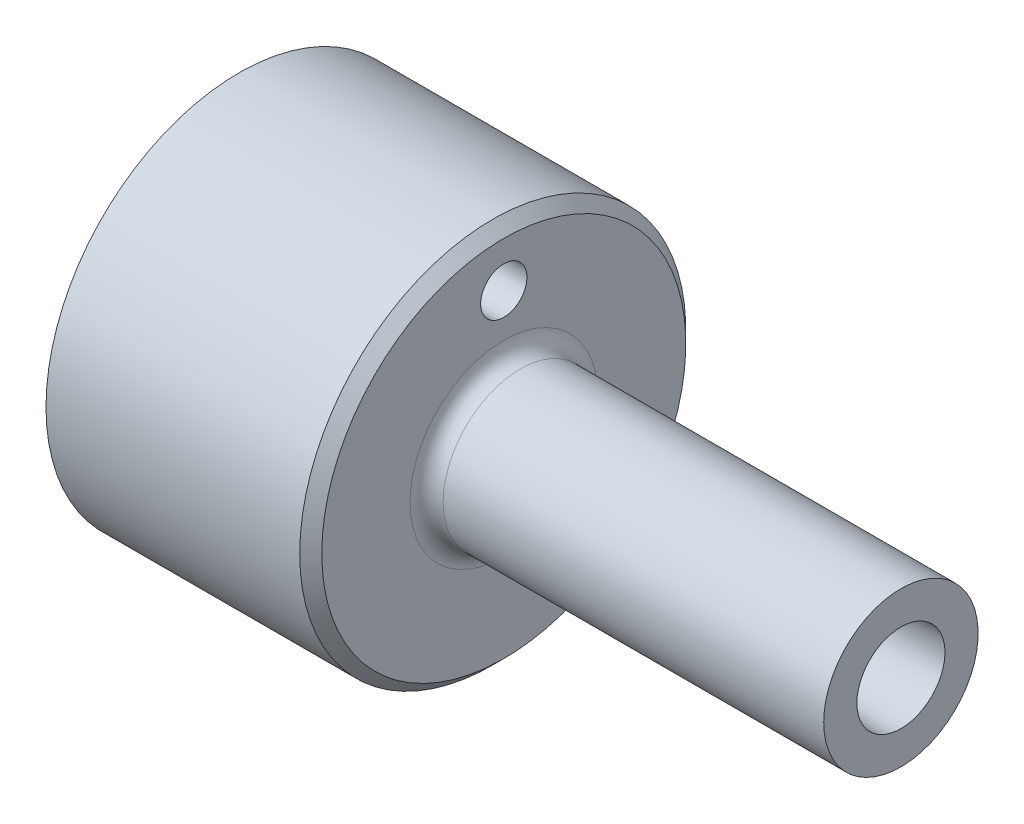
ISO-10303-21;
HEADER;
FILE_DESCRIPTION(('STEP AP214'),'2;1');
FILE_NAME('part.step','',(''),(''),'','','');
FILE_SCHEMA(('AUTOMOTIVE_DESIGN { 1 0 10303 214 1 1 1 1 }'));
ENDSEC;
DATA;
#1=APPLICATION_CONTEXT('core data for automotive mechanical design processes');
#2=APPLICATION_PROTOCOL_DEFINITION('international standard','automotive_design',2000,#1);
#3=PRODUCT_CONTEXT('',#1,'mechanical');
#4=PRODUCT('Part','Part','',(#3));
#5=PRODUCT_RELATED_PRODUCT_CATEGORY('part','',(#4));
#6=PRODUCT_DEFINITION_FORMATION('','',#4);
#7=PRODUCT_DEFINITION_CONTEXT('part definition',#1,'design');
#8=PRODUCT_DEFINITION('design','',#6,#7);
#9=PRODUCT_DEFINITION_SHAPE('','',#8);
#10=(LENGTH_UNIT() NAMED_UNIT(*) SI_UNIT(.MILLI.,.METRE.));
#11=(NAMED_UNIT(*) PLANE_ANGLE_UNIT() SI_UNIT($,.RADIAN.));
#12=(NAMED_UNIT(*) SI_UNIT($,.STERADIAN.) SOLID_ANGLE_UNIT());
#13=UNCERTAINTY_MEASURE_WITH_UNIT(LENGTH_MEASURE(1.E-05),#10,'distance_accuracy_value','');
#14=(GEOMETRIC_REPRESENTATION_CONTEXT(3) GLOBAL_UNCERTAINTY_ASSIGNED_CONTEXT((#13)) GLOBAL_UNIT_ASSIGNED_CONTEXT((#10,
#11,#12)) REPRESENTATION_CONTEXT('',''));
#15=CARTESIAN_POINT('',(0.,0.,0.));
#16=DIRECTION('',(0.,0.,1.));
#17=DIRECTION('',(1.,0.,0.));
#18=AXIS2_PLACEMENT_3D('',#15,#16,#17);
#19=CARTESIAN_POINT('',(25.5,0.,0.));
#20=DIRECTION('',(-1.,0.,0.));
#21=DIRECTION('',(0.,0.,1.));
#22=AXIS2_PLACEMENT_3D('',#19,#20,#21);
#23=TOROIDAL_SURFACE('',#22,8.5,1.5);
#24=CARTESIAN_POINT('',(24.,0.,0.));
#25=DIRECTION('',(-1.,0.,0.));
#26=DIRECTION('',(0.,0.,1.));
#27=AXIS2_PLACEMENT_3D('',#24,#25,#26);
#28=CIRCLE('',#27,8.5);
#29=CARTESIAN_POINT('',(24.,0.,8.5));
#30=VERTEX_POINT('',#29);
#31=EDGE_CURVE('E29',#30,#30,#28,.T.);
#32=ORIENTED_EDGE('',*,*,#31,.F.);
#33=EDGE_LOOP('',(#32));
#34=FACE_BOUND('',#33,.T.);
#35=CARTESIAN_POINT('',(25.5,0.,0.));
#36=DIRECTION('',(-1.,0.,0.));
#37=DIRECTION('',(0.,0.,1.));
#38=AXIS2_PLACEMENT_3D('',#35,#36,#37);
#39=CIRCLE('',#38,7.);
#40=CARTESIAN_POINT('',(25.5,0.,7.));
#41=VERTEX_POINT('',#40);
#42=EDGE_CURVE('E62',#41,#41,#39,.T.);
#43=ORIENTED_EDGE('',*,*,#42,.T.);
#44=EDGE_LOOP('',(#43));
#45=FACE_BOUND('',#44,.T.);
#46=ADVANCED_FACE('F13',(#34,#45),#23,.F.);
#47=CARTESIAN_POINT('',(24.,17.5,0.));
#48=DIRECTION('',(-1.,0.,0.));
#49=DIRECTION('',(0.,0.,1.));
#50=AXIS2_PLACEMENT_3D('',#47,#48,#49);
#51=PLANE('',#50);
#52=CARTESIAN_POINT('',(24.,0.,0.));
#53=DIRECTION('',(-1.,0.,0.));
#54=DIRECTION('',(0.,0.,1.));
#55=AXIS2_PLACEMENT_3D('',#52,#53,#54);
#56=CIRCLE('',#55,16.5);
#57=CARTESIAN_POINT('',(24.,0.,16.5));
#58=VERTEX_POINT('',#57);
#59=EDGE_CURVE('E8',#58,#58,#56,.F.);
#60=ORIENTED_EDGE('',*,*,#59,.T.);
#61=EDGE_LOOP('',(#60));
#62=FACE_BOUND('',#61,.T.);
#63=CARTESIAN_POINT('',(24.,12.4,0.));
#64=DIRECTION('',(-1.,0.,0.));
#65=DIRECTION('',(0.,0.,1.));
#66=AXIS2_PLACEMENT_3D('',#63,#64,#65);
#67=CIRCLE('',#66,2.1);
#68=CARTESIAN_POINT('',(24.,12.4,2.1));
#69=VERTEX_POINT('',#68);
#70=EDGE_CURVE('E39',#69,#69,#67,.T.);
#71=ORIENTED_EDGE('',*,*,#70,.T.);
#72=EDGE_LOOP('',(#71));
#73=FACE_BOUND('',#72,.T.);
#74=ORIENTED_EDGE('',*,*,#31,.T.);
#75=EDGE_LOOP('',(#74));
#76=FACE_BOUND('',#75,.T.);
#77=ADVANCED_FACE('F102',(#62,#73,#76),#51,.F.);
#78=CARTESIAN_POINT('',(0.,0.,0.));
#79=DIRECTION('',(-1.,0.,0.));
#80=DIRECTION('',(0.,0.,1.));
#81=AXIS2_PLACEMENT_3D('',#78,#79,#80);
#82=CYLINDRICAL_SURFACE('',#81,17.5);
#83=CARTESIAN_POINT('',(23.,0.,0.));
#84=DIRECTION('',(-1.,0.,0.));
#85=DIRECTION('',(0.,0.,1.));
#86=AXIS2_PLACEMENT_3D('',#83,#84,#85);
#87=CIRCLE('',#86,17.5);
#88=CARTESIAN_POINT('',(23.,0.,17.5));
#89=VERTEX_POINT('',#88);
#90=EDGE_CURVE('E21',#89,#89,#87,.T.);
#91=ORIENTED_EDGE('',*,*,#90,.T.);
#92=EDGE_LOOP('',(#91));
#93=FACE_BOUND('',#92,.T.);
#94=CARTESIAN_POINT('',(0.,0.,0.));
#95=DIRECTION('',(-1.,0.,0.));
#96=DIRECTION('',(0.,0.,1.));
#97=AXIS2_PLACEMENT_3D('',#94,#95,#96);
#98=CIRCLE('',#97,17.5);
#99=CARTESIAN_POINT('',(0.,0.,17.5));
#100=VERTEX_POINT('',#99);
#101=EDGE_CURVE('E36',#100,#100,#98,.T.);
#102=ORIENTED_EDGE('',*,*,#101,.F.);
#103=EDGE_LOOP('',(#102));
#104=FACE_BOUND('',#103,.T.);
#105=ADVANCED_FACE('F95',(#93,#104),#82,.T.);
#106=CARTESIAN_POINT('',(0.,4.10062261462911,0.));
#107=DIRECTION('',(1.,0.,0.));
#108=DIRECTION('',(0.,0.,-1.));
#109=AXIS2_PLACEMENT_3D('',#106,#107,#108);
#110=PLANE('',#109);
#111=CARTESIAN_POINT('',(0.,12.4,0.));
#112=DIRECTION('',(-1.,0.,0.));
#113=DIRECTION('',(0.,0.,1.));
#114=AXIS2_PLACEMENT_3D('',#111,#112,#113);
#115=CIRCLE('',#114,3.6);
#116=CARTESIAN_POINT('',(0.,12.4,3.6));
#117=VERTEX_POINT('',#116);
#118=EDGE_CURVE('E41',#117,#117,#115,.T.);
#119=ORIENTED_EDGE('',*,*,#118,.F.);
#120=EDGE_LOOP('',(#119));
#121=FACE_BOUND('',#120,.T.);
#122=CARTESIAN_POINT('',(0.,0.,0.));
#123=DIRECTION('',(-1.,0.,0.));
#124=DIRECTION('',(0.,0.,1.));
#125=AXIS2_PLACEMENT_3D('',#122,#123,#124);
#126=CIRCLE('',#125,4.10062261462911);
#127=CARTESIAN_POINT('',(0.,0.,4.10062261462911));
#128=VERTEX_POINT('',#127);
#129=EDGE_CURVE('E46',#128,#128,#126,.T.);
#130=ORIENTED_EDGE('',*,*,#129,.F.);
#131=EDGE_LOOP('',(#130));
#132=FACE_BOUND('',#131,.T.);
#133=ORIENTED_EDGE('',*,*,#101,.T.);
#134=EDGE_LOOP('',(#133));
#135=FACE_BOUND('',#134,.T.);
#136=ADVANCED_FACE('F91',(#121,#132,#135),#110,.F.);
#137=CARTESIAN_POINT('',(0.,0.,0.));
#138=DIRECTION('',(-1.,0.,0.));
#139=DIRECTION('',(0.,0.,1.));
#140=AXIS2_PLACEMENT_3D('',#137,#138,#139);
#141=CONICAL_SURFACE('',#140,4.10062261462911,0.610865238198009);
#142=CARTESIAN_POINT('',(3.,0.,0.));
#143=DIRECTION('',(-1.,0.,0.));
#144=DIRECTION('',(0.,0.,1.));
#145=AXIS2_PLACEMENT_3D('',#142,#143,#144);
#146=CIRCLE('',#145,2.);
#147=CARTESIAN_POINT('',(3.,0.,2.));
#148=VERTEX_POINT('',#147);
#149=EDGE_CURVE('E50',#148,#148,#146,.T.);
#150=ORIENTED_EDGE('',*,*,#149,.F.);
#151=EDGE_LOOP('',(#150));
#152=FACE_BOUND('',#151,.T.);
#153=ORIENTED_EDGE('',*,*,#129,.T.);
#154=EDGE_LOOP('',(#153));
#155=FACE_BOUND('',#154,.T.);
#156=ADVANCED_FACE('F94',(#152,#155),#141,.F.);
#157=CARTESIAN_POINT('',(3.,0.,0.));
#158=DIRECTION('',(1.,0.,0.));
#159=DIRECTION('',(0.,0.,-1.));
#160=AXIS2_PLACEMENT_3D('',#157,#158,#159);
#161=CONICAL_SURFACE('',#160,2.,0.0349065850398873);
#162=CARTESIAN_POINT('',(60.,0.,0.));
#163=DIRECTION('',(-1.,0.,0.));
#164=DIRECTION('',(0.,0.,1.));
#165=AXIS2_PLACEMENT_3D('',#162,#163,#164);
#166=CIRCLE('',#165,3.99048386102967);
#167=CARTESIAN_POINT('',(60.,0.,3.99048386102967));
#168=VERTEX_POINT('',#167);
#169=EDGE_CURVE('E54',#168,#168,#166,.T.);
#170=ORIENTED_EDGE('',*,*,#169,.F.);
#171=EDGE_LOOP('',(#170));
#172=FACE_BOUND('',#171,.T.);
#173=ORIENTED_EDGE('',*,*,#149,.T.);
#174=EDGE_LOOP('',(#173));
#175=FACE_BOUND('',#174,.T.);
#176=ADVANCED_FACE('F123',(#172,#175),#161,.F.);
#177=CARTESIAN_POINT('',(60.,7.,0.));
#178=DIRECTION('',(-1.,0.,0.));
#179=DIRECTION('',(0.,0.,1.));
#180=AXIS2_PLACEMENT_3D('',#177,#178,#179);
#181=PLANE('',#180);
#182=CARTESIAN_POINT('',(60.,0.,0.));
#183=DIRECTION('',(-1.,0.,0.));
#184=DIRECTION('',(0.,0.,1.));
#185=AXIS2_PLACEMENT_3D('',#182,#183,#184);
#186=CIRCLE('',#185,7.);
#187=CARTESIAN_POINT('',(60.,0.,7.));
#188=VERTEX_POINT('',#187);
#189=EDGE_CURVE('E58',#188,#188,#186,.T.);
#190=ORIENTED_EDGE('',*,*,#189,.F.);
#191=EDGE_LOOP('',(#190));
#192=FACE_BOUND('',#191,.T.);
#193=ORIENTED_EDGE('',*,*,#169,.T.);
#194=EDGE_LOOP('',(#193));
#195=FACE_BOUND('',#194,.T.);
#196=ADVANCED_FACE('F117',(#192,#195),#181,.F.);
#197=CARTESIAN_POINT('',(0.,0.,0.));
#198=DIRECTION('',(-1.,0.,0.));
#199=DIRECTION('',(0.,0.,1.));
#200=AXIS2_PLACEMENT_3D('',#197,#198,#199);
#201=CYLINDRICAL_SURFACE('',#200,7.);
#202=ORIENTED_EDGE('',*,*,#42,.F.);
#203=EDGE_LOOP('',(#202));
#204=FACE_BOUND('',#203,.T.);
#205=ORIENTED_EDGE('',*,*,#189,.T.);
#206=EDGE_LOOP('',(#205));
#207=FACE_BOUND('',#206,.T.);
#208=ADVANCED_FACE('F87',(#204,#207),#201,.T.);
#209=CARTESIAN_POINT('',(5.,12.4,0.));
#210=DIRECTION('',(-1.,0.,0.));
#211=DIRECTION('',(0.,0.,1.));
#212=AXIS2_PLACEMENT_3D('',#209,#210,#211);
#213=CYLINDRICAL_SURFACE('',#212,3.6);
#214=CARTESIAN_POINT('',(5.,12.4,0.));
#215=DIRECTION('',(-1.,0.,0.));
#216=DIRECTION('',(0.,0.,1.));
#217=AXIS2_PLACEMENT_3D('',#214,#215,#216);
#218=CIRCLE('',#217,3.6);
#219=CARTESIAN_POINT('',(5.,12.4,3.6));
#220=VERTEX_POINT('',#219);
#221=EDGE_CURVE('E65',#220,#220,#218,.T.);
#222=ORIENTED_EDGE('',*,*,#221,.F.);
#223=EDGE_LOOP('',(#222));
#224=FACE_BOUND('',#223,.T.);
#225=ORIENTED_EDGE('',*,*,#118,.T.);
#226=EDGE_LOOP('',(#225));
#227=FACE_BOUND('',#226,.T.);
#228=ADVANCED_FACE('F81',(#224,#227),#213,.F.);
#229=CARTESIAN_POINT('',(5.,12.4,0.));
#230=DIRECTION('',(-1.,0.,0.));
#231=DIRECTION('',(0.,0.,1.));
#232=AXIS2_PLACEMENT_3D('',#229,#230,#231);
#233=PLANE('',#232);
#234=CARTESIAN_POINT('',(5.,12.4,0.));
#235=DIRECTION('',(-1.,0.,0.));
#236=DIRECTION('',(0.,0.,1.));
#237=AXIS2_PLACEMENT_3D('',#234,#235,#236);
#238=CIRCLE('',#237,2.1);
#239=CARTESIAN_POINT('',(5.,12.4,2.1));
#240=VERTEX_POINT('',#239);
#241=EDGE_CURVE('E42',#240,#240,#238,.T.);
#242=ORIENTED_EDGE('',*,*,#241,.F.);
#243=EDGE_LOOP('',(#242));
#244=FACE_BOUND('',#243,.T.);
#245=ORIENTED_EDGE('',*,*,#221,.T.);
#246=EDGE_LOOP('',(#245));
#247=FACE_BOUND('',#246,.T.);
#248=ADVANCED_FACE('F78',(#244,#247),#233,.T.);
#249=CARTESIAN_POINT('',(60.,12.4,0.));
#250=DIRECTION('',(-1.,0.,0.));
#251=DIRECTION('',(0.,0.,1.));
#252=AXIS2_PLACEMENT_3D('',#249,#250,#251);
#253=CYLINDRICAL_SURFACE('',#252,2.1);
#254=ORIENTED_EDGE('',*,*,#241,.T.);
#255=EDGE_LOOP('',(#254));
#256=FACE_BOUND('',#255,.T.);
#257=ORIENTED_EDGE('',*,*,#70,.F.);
#258=EDGE_LOOP('',(#257));
#259=FACE_BOUND('',#258,.T.);
#260=ADVANCED_FACE('F75',(#256,#259),#253,.F.);
#261=CARTESIAN_POINT('',(23.,0.,0.));
#262=DIRECTION('',(-1.,0.,0.));
#263=DIRECTION('',(0.,0.,1.));
#264=AXIS2_PLACEMENT_3D('',#261,#262,#263);
#265=CONICAL_SURFACE('',#264,17.5,0.785398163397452);
#266=ORIENTED_EDGE('',*,*,#59,.F.);
#267=EDGE_LOOP('',(#266));
#268=FACE_BOUND('',#267,.T.);
#269=ORIENTED_EDGE('',*,*,#90,.F.);
#270=EDGE_LOOP('',(#269));
#271=FACE_BOUND('',#270,.T.);
#272=ADVANCED_FACE('F15',(#268,#271),#265,.T.);
#273=CLOSED_SHELL('',(#46,#77,#105,#136,#156,#176,#196,#208,#228,#248,#260,#272));
#274=MANIFOLD_SOLID_BREP('B1',#273);
#275=ADVANCED_BREP_SHAPE_REPRESENTATION('',(#18,#274),#14);
#276=SHAPE_DEFINITION_REPRESENTATION(#9,#275);
ENDSEC;
END-ISO-10303-21;
